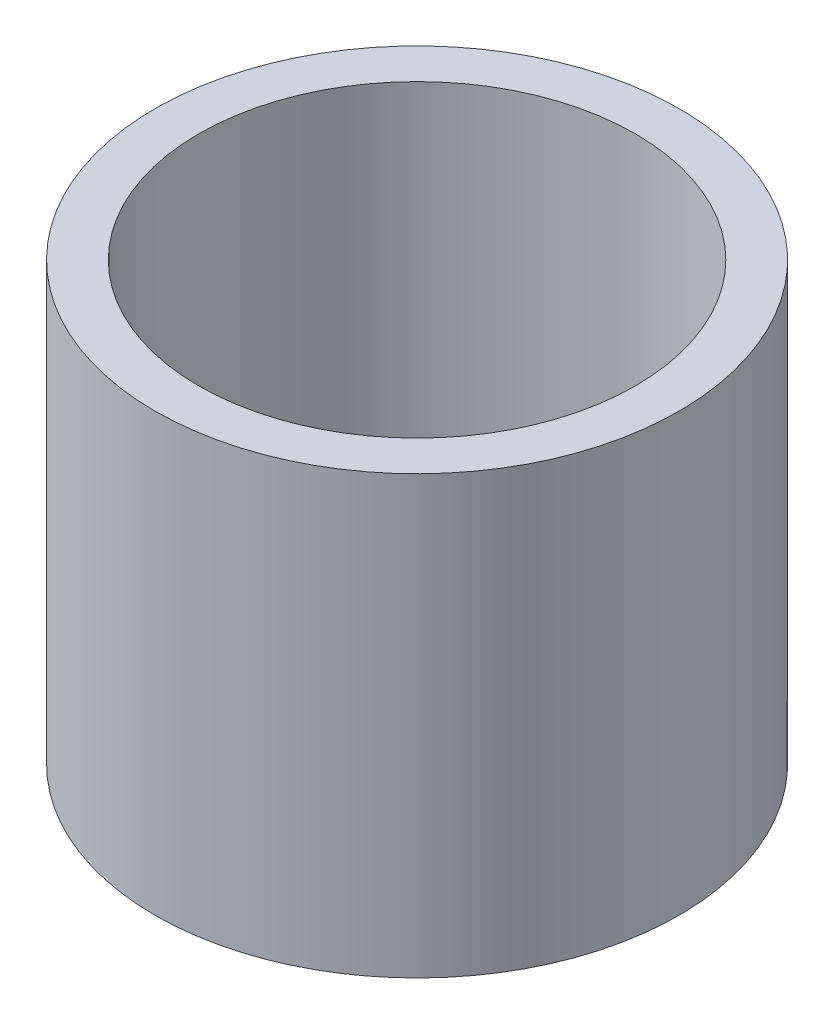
from build123d import *

# Parameters (mm, degrees)
SKETCH1_R           = 6
SKETCH1_R_2         = 5
BOSS_EXTRUDE1_DEPTH = 10


with BuildPart() as part:
    # Sketch1 → Boss-Extrude1 (new body)
    with BuildSketch(Plane(origin=(0, 0, 0), x_dir=(1, 0, 0), z_dir=(0, 1, 0))):
        with Locations(Location((0, 0, 0), (0, 0, 270))):
            Circle(SKETCH1_R)
        with Locations(Location((0, 0, 0), (0, 0, 270))):
            Circle(SKETCH1_R_2, mode=Mode.SUBTRACT)
    extrude(amount=BOSS_EXTRUDE1_DEPTH)


solid = part.part
